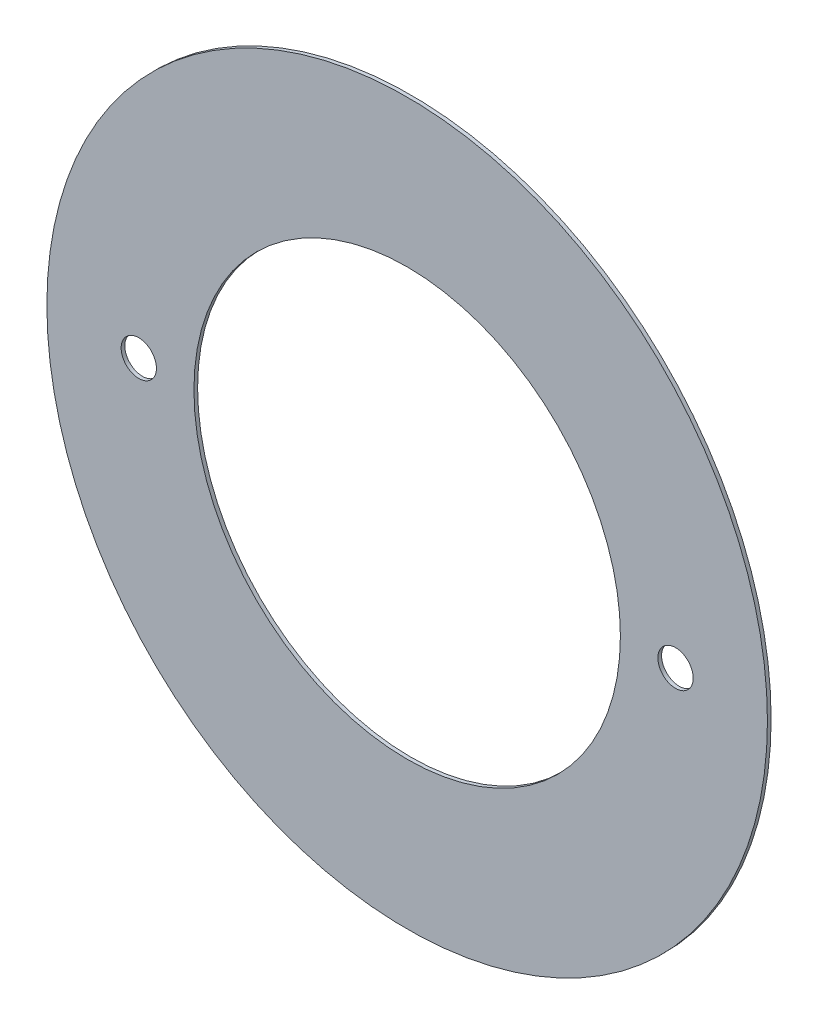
ISO-10303-21;
HEADER;
FILE_DESCRIPTION(('STEP AP214'),'2;1');
FILE_NAME('part.step','',(''),(''),'','','');
FILE_SCHEMA(('AUTOMOTIVE_DESIGN { 1 0 10303 214 1 1 1 1 }'));
ENDSEC;
DATA;
#1=APPLICATION_CONTEXT('core data for automotive mechanical design processes');
#2=APPLICATION_PROTOCOL_DEFINITION('international standard','automotive_design',2000,#1);
#3=PRODUCT_CONTEXT('',#1,'mechanical');
#4=PRODUCT('Part','Part','',(#3));
#5=PRODUCT_RELATED_PRODUCT_CATEGORY('part','',(#4));
#6=PRODUCT_DEFINITION_FORMATION('','',#4);
#7=PRODUCT_DEFINITION_CONTEXT('part definition',#1,'design');
#8=PRODUCT_DEFINITION('design','',#6,#7);
#9=PRODUCT_DEFINITION_SHAPE('','',#8);
#10=(LENGTH_UNIT() NAMED_UNIT(*) SI_UNIT(.MILLI.,.METRE.));
#11=(NAMED_UNIT(*) PLANE_ANGLE_UNIT() SI_UNIT($,.RADIAN.));
#12=(NAMED_UNIT(*) SI_UNIT($,.STERADIAN.) SOLID_ANGLE_UNIT());
#13=UNCERTAINTY_MEASURE_WITH_UNIT(LENGTH_MEASURE(1.E-05),#10,'distance_accuracy_value','');
#14=(GEOMETRIC_REPRESENTATION_CONTEXT(3) GLOBAL_UNCERTAINTY_ASSIGNED_CONTEXT((#13)) GLOBAL_UNIT_ASSIGNED_CONTEXT((#10,
#11,#12)) REPRESENTATION_CONTEXT('',''));
#15=CARTESIAN_POINT('',(0.,0.,0.));
#16=DIRECTION('',(0.,0.,1.));
#17=DIRECTION('',(1.,0.,0.));
#18=AXIS2_PLACEMENT_3D('',#15,#16,#17);
#19=CARTESIAN_POINT('',(0.,0.,0.5));
#20=DIRECTION('',(0.,0.,1.));
#21=DIRECTION('',(1.,0.,0.));
#22=AXIS2_PLACEMENT_3D('',#19,#20,#21);
#23=PLANE('',#22);
#24=CARTESIAN_POINT('',(36.5,0.,0.5));
#25=DIRECTION('',(0.,0.,1.));
#26=DIRECTION('',(1.,0.,0.));
#27=AXIS2_PLACEMENT_3D('',#24,#25,#26);
#28=CIRCLE('',#27,2.4);
#29=CARTESIAN_POINT('',(38.9,0.,0.5));
#30=VERTEX_POINT('',#29);
#31=EDGE_CURVE('E368',#30,#30,#28,.T.);
#32=ORIENTED_EDGE('',*,*,#31,.F.);
#33=EDGE_LOOP('',(#32));
#34=FACE_BOUND('',#33,.T.);
#35=CARTESIAN_POINT('',(0.,0.,0.5));
#36=DIRECTION('',(0.,0.,1.));
#37=DIRECTION('',(1.,0.,0.));
#38=AXIS2_PLACEMENT_3D('',#35,#36,#37);
#39=CIRCLE('',#38,49.);
#40=CARTESIAN_POINT('',(49.,0.,0.5));
#41=VERTEX_POINT('',#40);
#42=EDGE_CURVE('E10',#41,#41,#39,.T.);
#43=ORIENTED_EDGE('',*,*,#42,.T.);
#44=EDGE_LOOP('',(#43));
#45=FACE_BOUND('',#44,.T.);
#46=CARTESIAN_POINT('',(0.,0.,0.5));
#47=DIRECTION('',(0.,0.,1.));
#48=DIRECTION('',(1.,0.,0.));
#49=AXIS2_PLACEMENT_3D('',#46,#47,#48);
#50=CIRCLE('',#49,29.);
#51=CARTESIAN_POINT('',(29.,0.,0.5));
#52=VERTEX_POINT('',#51);
#53=EDGE_CURVE('E359',#52,#52,#50,.T.);
#54=ORIENTED_EDGE('',*,*,#53,.F.);
#55=EDGE_LOOP('',(#54));
#56=FACE_BOUND('',#55,.T.);
#57=CARTESIAN_POINT('',(-36.5,0.,0.5));
#58=DIRECTION('',(0.,0.,1.));
#59=DIRECTION('',(1.,0.,0.));
#60=AXIS2_PLACEMENT_3D('',#57,#58,#59);
#61=CIRCLE('',#60,2.4);
#62=CARTESIAN_POINT('',(-34.1,0.,0.5));
#63=VERTEX_POINT('',#62);
#64=EDGE_CURVE('E374',#63,#63,#61,.T.);
#65=ORIENTED_EDGE('',*,*,#64,.F.);
#66=EDGE_LOOP('',(#65));
#67=FACE_BOUND('',#66,.T.);
#68=ADVANCED_FACE('F348',(#34,#45,#56,#67),#23,.T.);
#69=CARTESIAN_POINT('',(0.,0.,0.));
#70=DIRECTION('',(0.,0.,1.));
#71=DIRECTION('',(1.,0.,0.));
#72=AXIS2_PLACEMENT_3D('',#69,#70,#71);
#73=PLANE('',#72);
#74=CARTESIAN_POINT('',(36.5,0.,0.));
#75=DIRECTION('',(0.,0.,1.));
#76=DIRECTION('',(1.,0.,0.));
#77=AXIS2_PLACEMENT_3D('',#74,#75,#76);
#78=CIRCLE('',#77,2.4);
#79=CARTESIAN_POINT('',(38.9,0.,0.));
#80=VERTEX_POINT('',#79);
#81=EDGE_CURVE('E371',#80,#80,#78,.T.);
#82=ORIENTED_EDGE('',*,*,#81,.T.);
#83=EDGE_LOOP('',(#82));
#84=FACE_BOUND('',#83,.T.);
#85=CARTESIAN_POINT('',(0.,0.,0.));
#86=DIRECTION('',(0.,0.,1.));
#87=DIRECTION('',(1.,0.,0.));
#88=AXIS2_PLACEMENT_3D('',#85,#86,#87);
#89=CIRCLE('',#88,49.);
#90=CARTESIAN_POINT('',(49.,0.,0.));
#91=VERTEX_POINT('',#90);
#92=EDGE_CURVE('E355',#91,#91,#89,.T.);
#93=ORIENTED_EDGE('',*,*,#92,.F.);
#94=EDGE_LOOP('',(#93));
#95=FACE_BOUND('',#94,.T.);
#96=CARTESIAN_POINT('',(0.,0.,0.));
#97=DIRECTION('',(0.,0.,1.));
#98=DIRECTION('',(1.,0.,0.));
#99=AXIS2_PLACEMENT_3D('',#96,#97,#98);
#100=CIRCLE('',#99,29.);
#101=CARTESIAN_POINT('',(29.,0.,0.));
#102=VERTEX_POINT('',#101);
#103=EDGE_CURVE('E363',#102,#102,#100,.T.);
#104=ORIENTED_EDGE('',*,*,#103,.T.);
#105=EDGE_LOOP('',(#104));
#106=FACE_BOUND('',#105,.T.);
#107=CARTESIAN_POINT('',(-36.5,0.,0.));
#108=DIRECTION('',(0.,0.,1.));
#109=DIRECTION('',(1.,0.,0.));
#110=AXIS2_PLACEMENT_3D('',#107,#108,#109);
#111=CIRCLE('',#110,2.4);
#112=CARTESIAN_POINT('',(-34.1,0.,0.));
#113=VERTEX_POINT('',#112);
#114=EDGE_CURVE('E377',#113,#113,#111,.T.);
#115=ORIENTED_EDGE('',*,*,#114,.T.);
#116=EDGE_LOOP('',(#115));
#117=FACE_BOUND('',#116,.T.);
#118=ADVANCED_FACE('F381',(#84,#95,#106,#117),#73,.F.);
#119=CARTESIAN_POINT('',(0.,0.,0.5));
#120=DIRECTION('',(0.,0.,-1.));
#121=DIRECTION('',(-1.,0.,0.));
#122=AXIS2_PLACEMENT_3D('',#119,#120,#121);
#123=CYLINDRICAL_SURFACE('',#122,49.);
#124=ORIENTED_EDGE('',*,*,#42,.F.);
#125=EDGE_LOOP('',(#124));
#126=FACE_BOUND('',#125,.T.);
#127=ORIENTED_EDGE('',*,*,#92,.T.);
#128=EDGE_LOOP('',(#127));
#129=FACE_BOUND('',#128,.T.);
#130=ADVANCED_FACE('F350',(#126,#129),#123,.T.);
#131=CARTESIAN_POINT('',(0.,0.,0.5));
#132=DIRECTION('',(0.,0.,-1.));
#133=DIRECTION('',(-1.,0.,0.));
#134=AXIS2_PLACEMENT_3D('',#131,#132,#133);
#135=CYLINDRICAL_SURFACE('',#134,29.);
#136=ORIENTED_EDGE('',*,*,#53,.T.);
#137=EDGE_LOOP('',(#136));
#138=FACE_BOUND('',#137,.T.);
#139=ORIENTED_EDGE('',*,*,#103,.F.);
#140=EDGE_LOOP('',(#139));
#141=FACE_BOUND('',#140,.T.);
#142=ADVANCED_FACE('F391',(#138,#141),#135,.F.);
#143=CARTESIAN_POINT('',(36.5,0.,0.5));
#144=DIRECTION('',(0.,0.,-1.));
#145=DIRECTION('',(-1.,0.,0.));
#146=AXIS2_PLACEMENT_3D('',#143,#144,#145);
#147=CYLINDRICAL_SURFACE('',#146,2.4);
#148=ORIENTED_EDGE('',*,*,#31,.T.);
#149=EDGE_LOOP('',(#148));
#150=FACE_BOUND('',#149,.T.);
#151=ORIENTED_EDGE('',*,*,#81,.F.);
#152=EDGE_LOOP('',(#151));
#153=FACE_BOUND('',#152,.T.);
#154=ADVANCED_FACE('F385',(#150,#153),#147,.F.);
#155=CARTESIAN_POINT('',(-36.5,0.,0.5));
#156=DIRECTION('',(0.,0.,-1.));
#157=DIRECTION('',(-1.,0.,0.));
#158=AXIS2_PLACEMENT_3D('',#155,#156,#157);
#159=CYLINDRICAL_SURFACE('',#158,2.4);
#160=ORIENTED_EDGE('',*,*,#64,.T.);
#161=EDGE_LOOP('',(#160));
#162=FACE_BOUND('',#161,.T.);
#163=ORIENTED_EDGE('',*,*,#114,.F.);
#164=EDGE_LOOP('',(#163));
#165=FACE_BOUND('',#164,.T.);
#166=ADVANCED_FACE('F383',(#162,#165),#159,.F.);
#167=CLOSED_SHELL('',(#68,#118,#130,#142,#154,#166));
#168=MANIFOLD_SOLID_BREP('B2',#167);
#169=ADVANCED_BREP_SHAPE_REPRESENTATION('',(#18,#168),#14);
#170=SHAPE_DEFINITION_REPRESENTATION(#9,#169);
ENDSEC;
END-ISO-10303-21;
